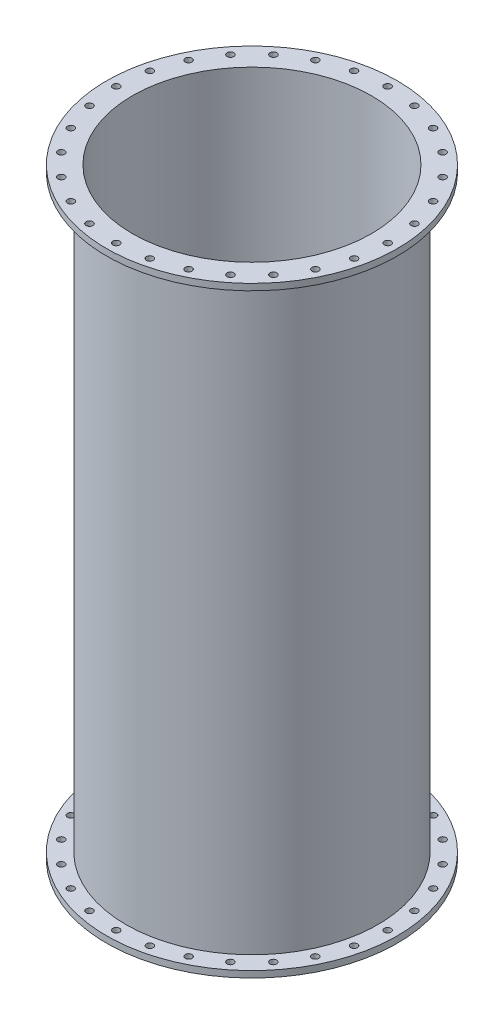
from build123d import *

# Parameters (mm, degrees)
CROQUIS3_R            = 5.25
CORTAR_EXTRUIR1_DEPTH = 984.970126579
MATRIZC4_COUNT        = 28


with BuildPart() as part:
    # Croquis1 → Revoluci_n1 (revolve)
    with BuildSketch(Plane.XY, mode=Mode.PRIVATE) as revoluci_n1_sk:
        Polygon((225, 0), (185, 0), (185, 931.1), (225, 931.1), (225, 921.1), (195, 921.1), (195, 10), (225, 10), align=None)
    revolve(revoluci_n1_sk.sketch.rotate(Axis((0, 0, 0), (0, 1, 0)), 90), axis=Axis((0, 0, 0), (0, 1, 0)))

    # Croquis3 → Cortar-Extruir1 (cut, through all)
    with BuildSketch(Plane(origin=(0, 931.1, 0), x_dir=(1, 0, 0), z_dir=(0, 1, 0))):
        with Locations(Location((0, 210, 0), (0, 0, 270))):
            Circle(CROQUIS3_R)
    cortar_extruir1 = extrude(amount=-CORTAR_EXTRUIR1_DEPTH, mode=Mode.SUBTRACT)

    # MatrizC4: Cortar-Extruir1 ×28 about axis
    matrizc4_axis = Axis((0, 0, 0), (0, 1, 0))
    for i in range(1, MATRIZC4_COUNT):
        add(cortar_extruir1.rotate(matrizc4_axis, i * 360 / MATRIZC4_COUNT), mode=Mode.SUBTRACT)


solid = part.part
